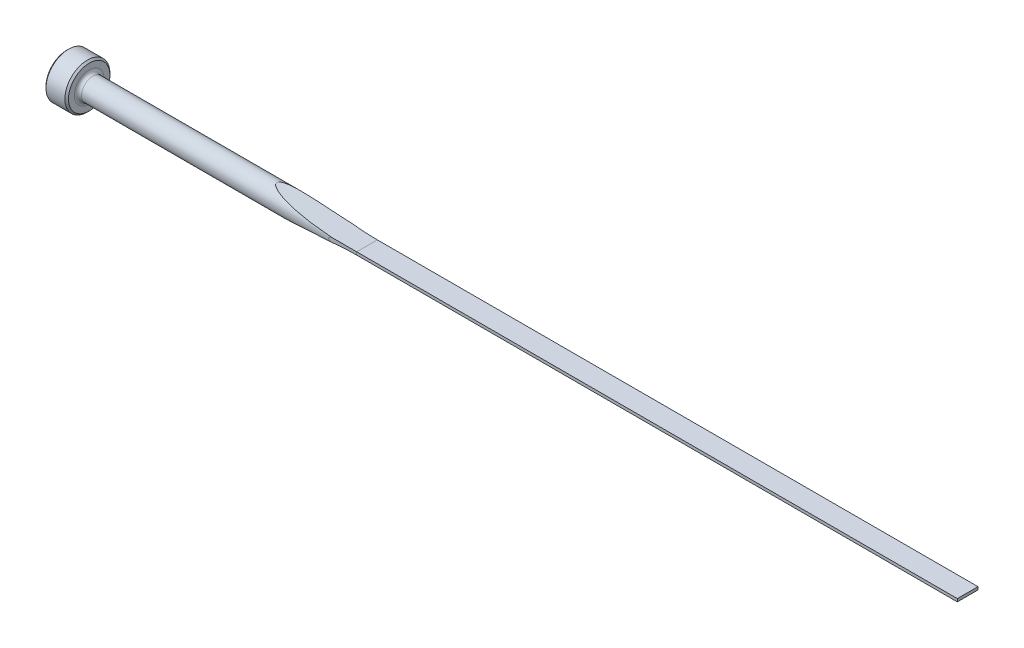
from build123d import *

# Parameters (mm, degrees)
CUT_EXTRUDE1_DEPTH = 191.619025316
CUT_EXTRUDE2_DEPTH = 191.619025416
FILLET1_R          = 0.762
CHAMFER1_SIZE      = 0.381


with BuildPart() as part:
    # Sketch1 → Revolve1 (revolve)
    with BuildSketch(Plane.XY, mode=Mode.PRIVATE) as revolve1_sk:
        Polygon((0, 0), (0, 4.7625), (4.7498, 4.7625), (4.7498, 2.3749), (190.5, 2.3749), (190.5, 0), align=None)
    revolve(revolve1_sk.sketch.rotate(Axis((0, 0, 0), (1, 0, 0)), 90), axis=Axis((0, 0, 0), (1, 0, 0)))

    # Sketch2 → Cut-Extrude1 (cut, symmetric)
    with BuildSketch(Plane.XY):
        with BuildLine():
            Line((190.5, 2.3749), (190.5, 0.3048))
            Line((190.5, 0.3048), (63.5, 0.3048))
            ThreePointArc((63.5, 0.3048), (53.907505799, 0.823840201), (44.427022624, 2.3749))
            Line((44.427022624, 2.3749), (190.5, 2.3749))
        make_face()
    cut_extrude1 = extrude(amount=CUT_EXTRUDE1_DEPTH, both=True, mode=Mode.SUBTRACT)

    # Mirror1: Cut-Extrude1 across plane
    add(cut_extrude1.mirror(Plane.ZX), mode=Mode.SUBTRACT)

    # Sketch3 → Cut-Extrude2 (cut, symmetric)
    with BuildSketch(Plane(origin=(0, 0, 0), x_dir=(1, 0, 0), z_dir=(0, 1, 0))):
        with BuildLine():
            Line((190.5, 2.3749), (190.5, 2.1844))
            Line((190.5, 2.1844), (63.5, 2.1844))
            ThreePointArc((63.5, 2.1844), (60.590064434, 2.232037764), (57.683247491, 2.3749))
            Line((57.683247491, 2.3749), (190.5, 2.3749))
        make_face()
    cut_extrude2 = extrude(amount=CUT_EXTRUDE2_DEPTH, both=True, mode=Mode.SUBTRACT)

    # Mirror2: Cut-Extrude2 across plane
    add(cut_extrude2.mirror(Plane.XY), mode=Mode.SUBTRACT)

    # Fillet1
    fillet1_edges = [part.edges().sort_by_distance(p)[0] for p in [
        (4.7498, 0, -2.3749),
    ]]
    fillet(fillet1_edges, radius=FILLET1_R)

    # Chamfer1
    chamfer1_edges = [part.edges().sort_by_distance(p)[0] for p in [
        (4.7498, 0, -4.7625),
        (0, 0, -4.7625),
    ]]
    chamfer(chamfer1_edges, length=CHAMFER1_SIZE)


solid = part.part
